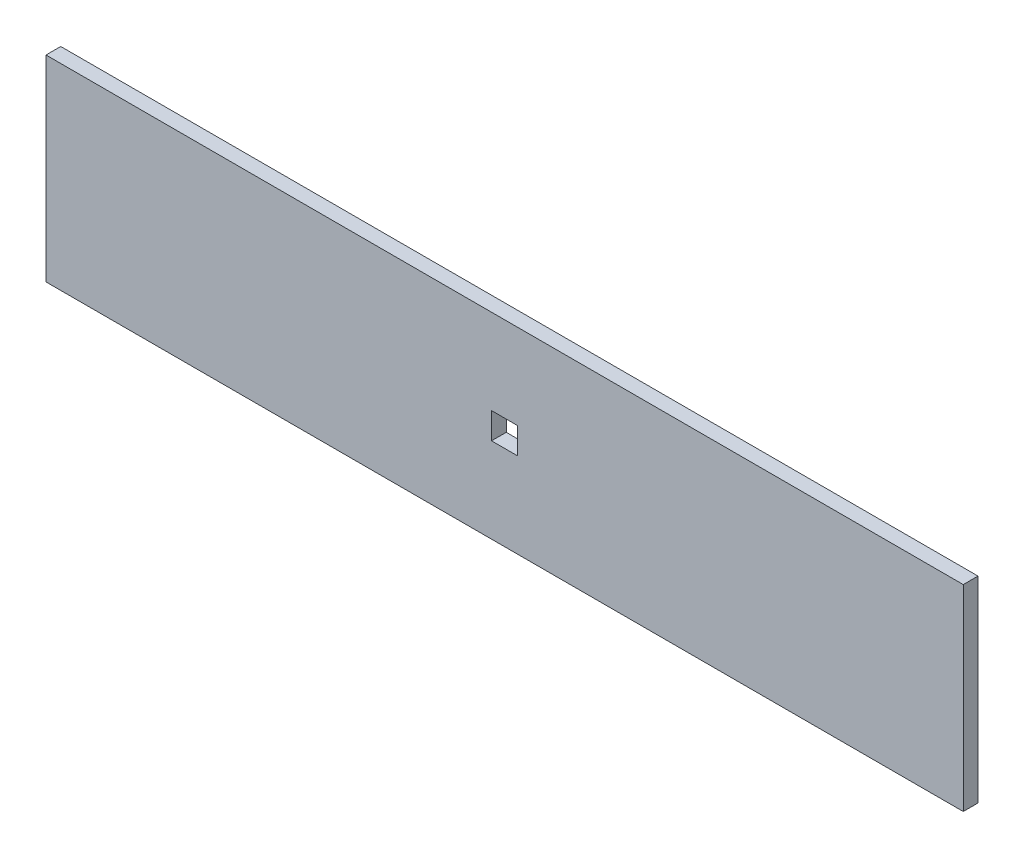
ISO-10303-21;
HEADER;
FILE_DESCRIPTION(('STEP AP214'),'2;1');
FILE_NAME('part.step','',(''),(''),'','','');
FILE_SCHEMA(('AUTOMOTIVE_DESIGN { 1 0 10303 214 1 1 1 1 }'));
ENDSEC;
DATA;
#1=APPLICATION_CONTEXT('core data for automotive mechanical design processes');
#2=APPLICATION_PROTOCOL_DEFINITION('international standard','automotive_design',2000,#1);
#3=PRODUCT_CONTEXT('',#1,'mechanical');
#4=PRODUCT('Part','Part','',(#3));
#5=PRODUCT_RELATED_PRODUCT_CATEGORY('part','',(#4));
#6=PRODUCT_DEFINITION_FORMATION('','',#4);
#7=PRODUCT_DEFINITION_CONTEXT('part definition',#1,'design');
#8=PRODUCT_DEFINITION('design','',#6,#7);
#9=PRODUCT_DEFINITION_SHAPE('','',#8);
#10=(LENGTH_UNIT() NAMED_UNIT(*) SI_UNIT(.MILLI.,.METRE.));
#11=(NAMED_UNIT(*) PLANE_ANGLE_UNIT() SI_UNIT($,.RADIAN.));
#12=(NAMED_UNIT(*) SI_UNIT($,.STERADIAN.) SOLID_ANGLE_UNIT());
#13=UNCERTAINTY_MEASURE_WITH_UNIT(LENGTH_MEASURE(1.E-05),#10,'distance_accuracy_value','');
#14=(GEOMETRIC_REPRESENTATION_CONTEXT(3) GLOBAL_UNCERTAINTY_ASSIGNED_CONTEXT((#13)) GLOBAL_UNIT_ASSIGNED_CONTEXT((#10,
#11,#12)) REPRESENTATION_CONTEXT('',''));
#15=CARTESIAN_POINT('',(0.,0.,0.));
#16=DIRECTION('',(0.,0.,1.));
#17=DIRECTION('',(1.,0.,0.));
#18=AXIS2_PLACEMENT_3D('',#15,#16,#17);
#19=CARTESIAN_POINT('',(-140.,-30.,4.5));
#20=DIRECTION('',(1.,0.,0.));
#21=DIRECTION('',(0.,0.,-1.));
#22=AXIS2_PLACEMENT_3D('',#19,#20,#21);
#23=PLANE('',#22);
#24=DIRECTION('',(0.,-1.,0.));
#25=VECTOR('',#24,1.);
#26=CARTESIAN_POINT('',(-140.,-30.,0.));
#27=LINE('',#26,#25);
#28=CARTESIAN_POINT('',(-140.,30.,0.));
#29=VERTEX_POINT('',#28);
#30=CARTESIAN_POINT('',(-140.,-30.,0.));
#31=VERTEX_POINT('',#30);
#32=EDGE_CURVE('E131',#29,#31,#27,.T.);
#33=ORIENTED_EDGE('',*,*,#32,.T.);
#34=DIRECTION('',(0.,0.,-1.));
#35=VECTOR('',#34,1.);
#36=CARTESIAN_POINT('',(-140.,-30.,4.5));
#37=LINE('',#36,#35);
#38=CARTESIAN_POINT('',(-140.,-30.,4.5));
#39=VERTEX_POINT('',#38);
#40=EDGE_CURVE('E11',#39,#31,#37,.T.);
#41=ORIENTED_EDGE('',*,*,#40,.F.);
#42=DIRECTION('',(0.,-1.,0.));
#43=VECTOR('',#42,1.);
#44=CARTESIAN_POINT('',(-140.,-30.,4.5));
#45=LINE('',#44,#43);
#46=CARTESIAN_POINT('',(-140.,30.,4.5));
#47=VERTEX_POINT('',#46);
#48=EDGE_CURVE('E135',#47,#39,#45,.T.);
#49=ORIENTED_EDGE('',*,*,#48,.F.);
#50=DIRECTION('',(0.,0.,-1.));
#51=VECTOR('',#50,1.);
#52=CARTESIAN_POINT('',(-140.,30.,4.5));
#53=LINE('',#52,#51);
#54=EDGE_CURVE('E145',#47,#29,#53,.T.);
#55=ORIENTED_EDGE('',*,*,#54,.T.);
#56=EDGE_LOOP('',(#33,#41,#49,#55));
#57=FACE_BOUND('',#56,.T.);
#58=ADVANCED_FACE('F34',(#57),#23,.F.);
#59=CARTESIAN_POINT('',(140.,-30.,4.5));
#60=DIRECTION('',(0.,1.,0.));
#61=DIRECTION('',(-1.,0.,0.));
#62=AXIS2_PLACEMENT_3D('',#59,#60,#61);
#63=PLANE('',#62);
#64=DIRECTION('',(1.,0.,0.));
#65=VECTOR('',#64,1.);
#66=CARTESIAN_POINT('',(140.,-30.,0.));
#67=LINE('',#66,#65);
#68=CARTESIAN_POINT('',(140.,-30.,0.));
#69=VERTEX_POINT('',#68);
#70=EDGE_CURVE('E148',#31,#69,#67,.T.);
#71=ORIENTED_EDGE('',*,*,#70,.T.);
#72=DIRECTION('',(0.,0.,-1.));
#73=VECTOR('',#72,1.);
#74=CARTESIAN_POINT('',(140.,-30.,4.5));
#75=LINE('',#74,#73);
#76=CARTESIAN_POINT('',(140.,-30.,4.5));
#77=VERTEX_POINT('',#76);
#78=EDGE_CURVE('E41',#77,#69,#75,.T.);
#79=ORIENTED_EDGE('',*,*,#78,.F.);
#80=DIRECTION('',(1.,0.,0.));
#81=VECTOR('',#80,1.);
#82=CARTESIAN_POINT('',(140.,-30.,4.5));
#83=LINE('',#82,#81);
#84=EDGE_CURVE('E138',#39,#77,#83,.T.);
#85=ORIENTED_EDGE('',*,*,#84,.F.);
#86=ORIENTED_EDGE('',*,*,#40,.T.);
#87=EDGE_LOOP('',(#71,#79,#85,#86));
#88=FACE_BOUND('',#87,.T.);
#89=ADVANCED_FACE('F176',(#88),#63,.F.);
#90=CARTESIAN_POINT('',(140.,-30.,4.5));
#91=DIRECTION('',(-1.,0.,0.));
#92=DIRECTION('',(0.,0.,1.));
#93=AXIS2_PLACEMENT_3D('',#90,#91,#92);
#94=PLANE('',#93);
#95=DIRECTION('',(0.,1.,0.));
#96=VECTOR('',#95,1.);
#97=CARTESIAN_POINT('',(140.,-30.,0.));
#98=LINE('',#97,#96);
#99=CARTESIAN_POINT('',(140.,30.,0.));
#100=VERTEX_POINT('',#99);
#101=EDGE_CURVE('E150',#69,#100,#98,.T.);
#102=ORIENTED_EDGE('',*,*,#101,.T.);
#103=DIRECTION('',(0.,0.,-1.));
#104=VECTOR('',#103,1.);
#105=CARTESIAN_POINT('',(140.,30.,4.5));
#106=LINE('',#105,#104);
#107=CARTESIAN_POINT('',(140.,30.,4.5));
#108=VERTEX_POINT('',#107);
#109=EDGE_CURVE('E155',#108,#100,#106,.T.);
#110=ORIENTED_EDGE('',*,*,#109,.F.);
#111=DIRECTION('',(0.,1.,0.));
#112=VECTOR('',#111,1.);
#113=CARTESIAN_POINT('',(140.,-30.,4.5));
#114=LINE('',#113,#112);
#115=EDGE_CURVE('E141',#77,#108,#114,.T.);
#116=ORIENTED_EDGE('',*,*,#115,.F.);
#117=ORIENTED_EDGE('',*,*,#78,.T.);
#118=EDGE_LOOP('',(#102,#110,#116,#117));
#119=FACE_BOUND('',#118,.T.);
#120=ADVANCED_FACE('F162',(#119),#94,.F.);
#121=CARTESIAN_POINT('',(140.,30.,4.5));
#122=DIRECTION('',(0.,-1.,0.));
#123=DIRECTION('',(1.,0.,0.));
#124=AXIS2_PLACEMENT_3D('',#121,#122,#123);
#125=PLANE('',#124);
#126=DIRECTION('',(-1.,0.,0.));
#127=VECTOR('',#126,1.);
#128=CARTESIAN_POINT('',(140.,30.,0.));
#129=LINE('',#128,#127);
#130=EDGE_CURVE('E139',#100,#29,#129,.T.);
#131=ORIENTED_EDGE('',*,*,#130,.T.);
#132=ORIENTED_EDGE('',*,*,#54,.F.);
#133=DIRECTION('',(-1.,0.,0.));
#134=VECTOR('',#133,1.);
#135=CARTESIAN_POINT('',(140.,30.,4.5));
#136=LINE('',#135,#134);
#137=EDGE_CURVE('E143',#108,#47,#136,.T.);
#138=ORIENTED_EDGE('',*,*,#137,.F.);
#139=ORIENTED_EDGE('',*,*,#109,.T.);
#140=EDGE_LOOP('',(#131,#132,#138,#139));
#141=FACE_BOUND('',#140,.T.);
#142=ADVANCED_FACE('F169',(#141),#125,.F.);
#143=CARTESIAN_POINT('',(0.,0.,4.5));
#144=DIRECTION('',(0.,0.,1.));
#145=DIRECTION('',(1.,0.,0.));
#146=AXIS2_PLACEMENT_3D('',#143,#144,#145);
#147=PLANE('',#146);
#148=DIRECTION('',(0.,-1.,0.));
#149=VECTOR('',#148,1.);
#150=CARTESIAN_POINT('',(-4.,-4.,4.5));
#151=LINE('',#150,#149);
#152=CARTESIAN_POINT('',(-4.,4.,4.5));
#153=VERTEX_POINT('',#152);
#154=CARTESIAN_POINT('',(-4.,-4.,4.5));
#155=VERTEX_POINT('',#154);
#156=EDGE_CURVE('E48',#153,#155,#151,.T.);
#157=ORIENTED_EDGE('',*,*,#156,.F.);
#158=DIRECTION('',(-1.,0.,0.));
#159=VECTOR('',#158,1.);
#160=CARTESIAN_POINT('',(4.,4.,4.5));
#161=LINE('',#160,#159);
#162=CARTESIAN_POINT('',(4.,4.,4.5));
#163=VERTEX_POINT('',#162);
#164=EDGE_CURVE('E116',#163,#153,#161,.T.);
#165=ORIENTED_EDGE('',*,*,#164,.F.);
#166=DIRECTION('',(0.,1.,0.));
#167=VECTOR('',#166,1.);
#168=CARTESIAN_POINT('',(4.,-4.,4.5));
#169=LINE('',#168,#167);
#170=CARTESIAN_POINT('',(4.,-4.,4.5));
#171=VERTEX_POINT('',#170);
#172=EDGE_CURVE('E119',#171,#163,#169,.T.);
#173=ORIENTED_EDGE('',*,*,#172,.F.);
#174=DIRECTION('',(1.,0.,0.));
#175=VECTOR('',#174,1.);
#176=CARTESIAN_POINT('',(4.,-4.,4.5));
#177=LINE('',#176,#175);
#178=EDGE_CURVE('E125',#155,#171,#177,.T.);
#179=ORIENTED_EDGE('',*,*,#178,.F.);
#180=EDGE_LOOP('',(#157,#165,#173,#179));
#181=FACE_BOUND('',#180,.T.);
#182=ORIENTED_EDGE('',*,*,#48,.T.);
#183=ORIENTED_EDGE('',*,*,#84,.T.);
#184=ORIENTED_EDGE('',*,*,#115,.T.);
#185=ORIENTED_EDGE('',*,*,#137,.T.);
#186=EDGE_LOOP('',(#182,#183,#184,#185));
#187=FACE_BOUND('',#186,.T.);
#188=ADVANCED_FACE('F175',(#181,#187),#147,.T.);
#189=CARTESIAN_POINT('',(0.,0.,0.));
#190=DIRECTION('',(0.,0.,1.));
#191=DIRECTION('',(1.,0.,0.));
#192=AXIS2_PLACEMENT_3D('',#189,#190,#191);
#193=PLANE('',#192);
#194=DIRECTION('',(-1.,0.,0.));
#195=VECTOR('',#194,1.);
#196=CARTESIAN_POINT('',(4.,4.,0.));
#197=LINE('',#196,#195);
#198=CARTESIAN_POINT('',(4.,4.,0.));
#199=VERTEX_POINT('',#198);
#200=CARTESIAN_POINT('',(-4.,4.,0.));
#201=VERTEX_POINT('',#200);
#202=EDGE_CURVE('E106',#199,#201,#197,.T.);
#203=ORIENTED_EDGE('',*,*,#202,.T.);
#204=DIRECTION('',(0.,-1.,0.));
#205=VECTOR('',#204,1.);
#206=CARTESIAN_POINT('',(-4.,-4.,0.));
#207=LINE('',#206,#205);
#208=CARTESIAN_POINT('',(-4.,-4.,0.));
#209=VERTEX_POINT('',#208);
#210=EDGE_CURVE('E100',#201,#209,#207,.T.);
#211=ORIENTED_EDGE('',*,*,#210,.T.);
#212=DIRECTION('',(1.,0.,0.));
#213=VECTOR('',#212,1.);
#214=CARTESIAN_POINT('',(4.,-4.,0.));
#215=LINE('',#214,#213);
#216=CARTESIAN_POINT('',(4.,-4.,0.));
#217=VERTEX_POINT('',#216);
#218=EDGE_CURVE('E109',#209,#217,#215,.T.);
#219=ORIENTED_EDGE('',*,*,#218,.T.);
#220=DIRECTION('',(0.,1.,0.));
#221=VECTOR('',#220,1.);
#222=CARTESIAN_POINT('',(4.,-4.,0.));
#223=LINE('',#222,#221);
#224=EDGE_CURVE('E56',#217,#199,#223,.T.);
#225=ORIENTED_EDGE('',*,*,#224,.T.);
#226=EDGE_LOOP('',(#203,#211,#219,#225));
#227=FACE_BOUND('',#226,.T.);
#228=ORIENTED_EDGE('',*,*,#32,.F.);
#229=ORIENTED_EDGE('',*,*,#130,.F.);
#230=ORIENTED_EDGE('',*,*,#101,.F.);
#231=ORIENTED_EDGE('',*,*,#70,.F.);
#232=EDGE_LOOP('',(#228,#229,#230,#231));
#233=FACE_BOUND('',#232,.T.);
#234=ADVANCED_FACE('F113',(#227,#233),#193,.F.);
#235=CARTESIAN_POINT('',(-4.,-4.,0.));
#236=DIRECTION('',(-1.,0.,0.));
#237=DIRECTION('',(0.,0.,1.));
#238=AXIS2_PLACEMENT_3D('',#235,#236,#237);
#239=PLANE('',#238);
#240=ORIENTED_EDGE('',*,*,#156,.T.);
#241=DIRECTION('',(0.,0.,1.));
#242=VECTOR('',#241,1.);
#243=CARTESIAN_POINT('',(-4.,-4.,0.));
#244=LINE('',#243,#242);
#245=EDGE_CURVE('E96',#209,#155,#244,.T.);
#246=ORIENTED_EDGE('',*,*,#245,.F.);
#247=ORIENTED_EDGE('',*,*,#210,.F.);
#248=DIRECTION('',(0.,0.,1.));
#249=VECTOR('',#248,1.);
#250=CARTESIAN_POINT('',(-4.,4.,0.));
#251=LINE('',#250,#249);
#252=EDGE_CURVE('E129',#201,#153,#251,.T.);
#253=ORIENTED_EDGE('',*,*,#252,.T.);
#254=EDGE_LOOP('',(#240,#246,#247,#253));
#255=FACE_BOUND('',#254,.T.);
#256=ADVANCED_FACE('F98',(#255),#239,.F.);
#257=CARTESIAN_POINT('',(4.,4.,0.));
#258=DIRECTION('',(0.,1.,0.));
#259=DIRECTION('',(-1.,0.,0.));
#260=AXIS2_PLACEMENT_3D('',#257,#258,#259);
#261=PLANE('',#260);
#262=ORIENTED_EDGE('',*,*,#164,.T.);
#263=ORIENTED_EDGE('',*,*,#252,.F.);
#264=ORIENTED_EDGE('',*,*,#202,.F.);
#265=DIRECTION('',(0.,0.,1.));
#266=VECTOR('',#265,1.);
#267=CARTESIAN_POINT('',(4.,4.,0.));
#268=LINE('',#267,#266);
#269=EDGE_CURVE('E132',#199,#163,#268,.T.);
#270=ORIENTED_EDGE('',*,*,#269,.T.);
#271=EDGE_LOOP('',(#262,#263,#264,#270));
#272=FACE_BOUND('',#271,.T.);
#273=ADVANCED_FACE('F193',(#272),#261,.F.);
#274=CARTESIAN_POINT('',(4.,-4.,0.));
#275=DIRECTION('',(1.,0.,0.));
#276=DIRECTION('',(0.,0.,-1.));
#277=AXIS2_PLACEMENT_3D('',#274,#275,#276);
#278=PLANE('',#277);
#279=ORIENTED_EDGE('',*,*,#172,.T.);
#280=ORIENTED_EDGE('',*,*,#269,.F.);
#281=ORIENTED_EDGE('',*,*,#224,.F.);
#282=DIRECTION('',(0.,0.,1.));
#283=VECTOR('',#282,1.);
#284=CARTESIAN_POINT('',(4.,-4.,0.));
#285=LINE('',#284,#283);
#286=EDGE_CURVE('E105',#217,#171,#285,.T.);
#287=ORIENTED_EDGE('',*,*,#286,.T.);
#288=EDGE_LOOP('',(#279,#280,#281,#287));
#289=FACE_BOUND('',#288,.T.);
#290=ADVANCED_FACE('F196',(#289),#278,.F.);
#291=CARTESIAN_POINT('',(4.,-4.,0.));
#292=DIRECTION('',(0.,-1.,0.));
#293=DIRECTION('',(1.,0.,0.));
#294=AXIS2_PLACEMENT_3D('',#291,#292,#293);
#295=PLANE('',#294);
#296=ORIENTED_EDGE('',*,*,#178,.T.);
#297=ORIENTED_EDGE('',*,*,#286,.F.);
#298=ORIENTED_EDGE('',*,*,#218,.F.);
#299=ORIENTED_EDGE('',*,*,#245,.T.);
#300=EDGE_LOOP('',(#296,#297,#298,#299));
#301=FACE_BOUND('',#300,.T.);
#302=ADVANCED_FACE('F110',(#301),#295,.F.);
#303=CLOSED_SHELL('',(#58,#89,#120,#142,#188,#234,#256,#273,#290,#302));
#304=MANIFOLD_SOLID_BREP('B2',#303);
#305=ADVANCED_BREP_SHAPE_REPRESENTATION('',(#18,#304),#14);
#306=SHAPE_DEFINITION_REPRESENTATION(#9,#305);
ENDSEC;
END-ISO-10303-21;
